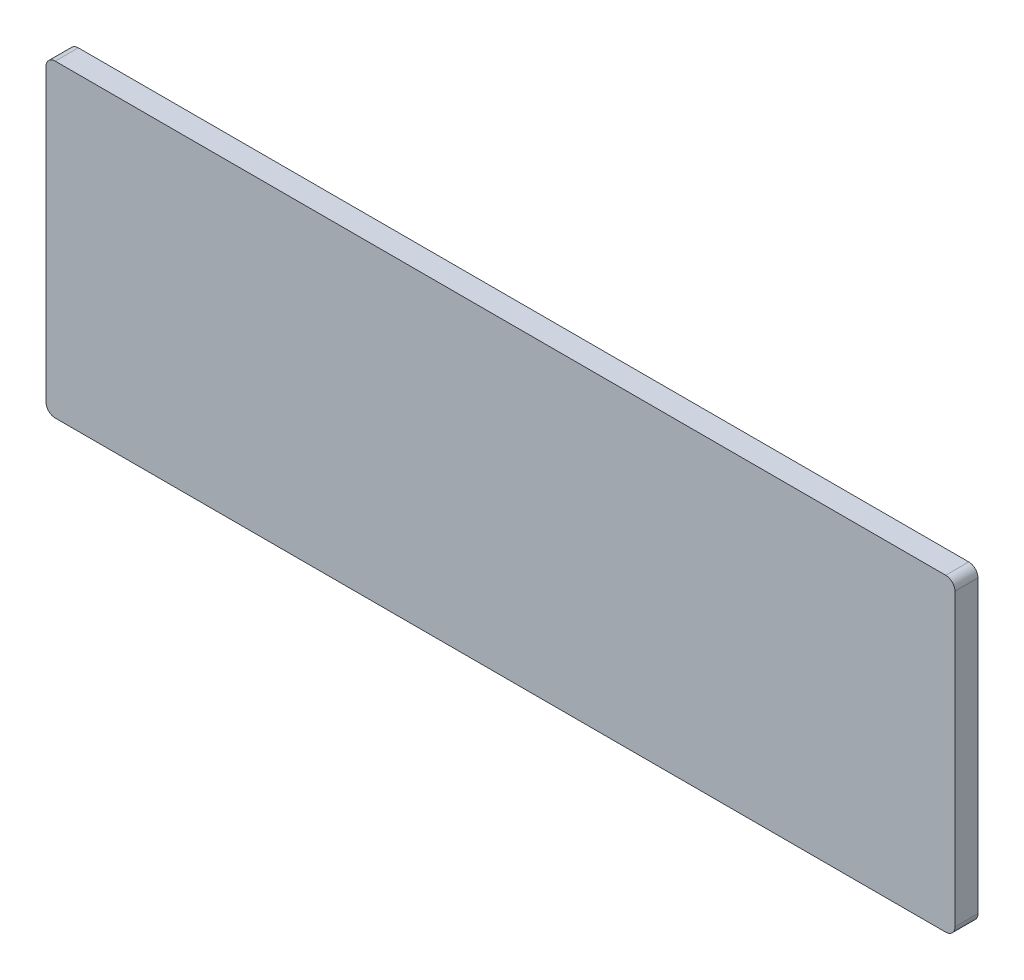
from build123d import *

# Parameters (mm, degrees)
SKETCH1_W           = 197
SKETCH1_H           = 67
BOSS_EXTRUDE1_DEPTH = 5
FILLET1_R           = 2


with BuildPart() as part:
    # Sketch1 → Boss-Extrude1 (new body)
    with BuildSketch(Plane.XY):
        with Locations((98.5, 33.5)):
            Rectangle(SKETCH1_W, SKETCH1_H)
    extrude(amount=BOSS_EXTRUDE1_DEPTH)

    # Fillet1
    fillet1_edges = [part.edges().sort_by_distance(p)[0] for p in [
        (0, 67, 2.5),
        (197, 67, 2.5),
        (197, 0, 2.5),
        (0, 0, 2.5),
    ]]
    fillet(fillet1_edges, radius=FILLET1_R)


solid = part.part
